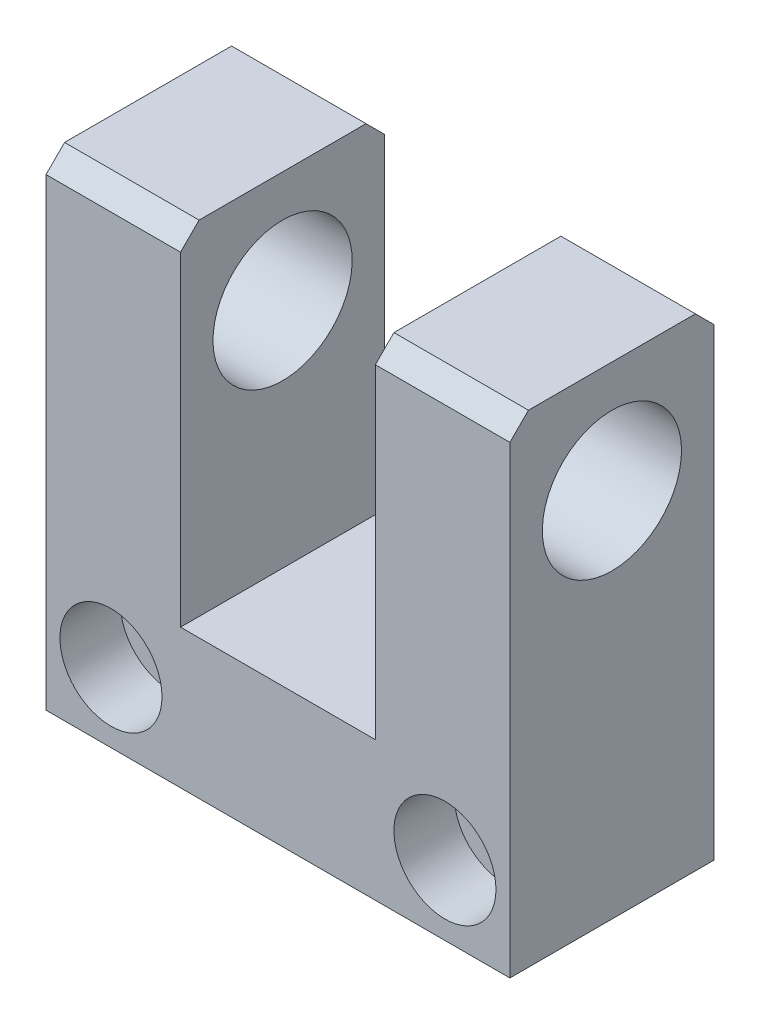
ISO-10303-21;
HEADER;
FILE_DESCRIPTION(('STEP AP214'),'2;1');
FILE_NAME('part.step','',(''),(''),'','','');
FILE_SCHEMA(('AUTOMOTIVE_DESIGN { 1 0 10303 214 1 1 1 1 }'));
ENDSEC;
DATA;
#1=APPLICATION_CONTEXT('core data for automotive mechanical design processes');
#2=APPLICATION_PROTOCOL_DEFINITION('international standard','automotive_design',2000,#1);
#3=PRODUCT_CONTEXT('',#1,'mechanical');
#4=PRODUCT('Part','Part','',(#3));
#5=PRODUCT_RELATED_PRODUCT_CATEGORY('part','',(#4));
#6=PRODUCT_DEFINITION_FORMATION('','',#4);
#7=PRODUCT_DEFINITION_CONTEXT('part definition',#1,'design');
#8=PRODUCT_DEFINITION('design','',#6,#7);
#9=PRODUCT_DEFINITION_SHAPE('','',#8);
#10=(LENGTH_UNIT() NAMED_UNIT(*) SI_UNIT(.MILLI.,.METRE.));
#11=(NAMED_UNIT(*) PLANE_ANGLE_UNIT() SI_UNIT($,.RADIAN.));
#12=(NAMED_UNIT(*) SI_UNIT($,.STERADIAN.) SOLID_ANGLE_UNIT());
#13=UNCERTAINTY_MEASURE_WITH_UNIT(LENGTH_MEASURE(1.E-05),#10,'distance_accuracy_value','');
#14=(GEOMETRIC_REPRESENTATION_CONTEXT(3) GLOBAL_UNCERTAINTY_ASSIGNED_CONTEXT((#13)) GLOBAL_UNIT_ASSIGNED_CONTEXT((#10,
#11,#12)) REPRESENTATION_CONTEXT('',''));
#15=CARTESIAN_POINT('',(0.,0.,0.));
#16=DIRECTION('',(0.,0.,1.));
#17=DIRECTION('',(1.,0.,0.));
#18=AXIS2_PLACEMENT_3D('',#15,#16,#17);
#19=CARTESIAN_POINT('',(25.,50.,11.));
#20=DIRECTION('',(0.,0.,-1.));
#21=DIRECTION('',(-1.,0.,0.));
#22=AXIS2_PLACEMENT_3D('',#19,#20,#21);
#23=PLANE('',#22);
#24=CARTESIAN_POINT('',(18.,7.5,11.));
#25=DIRECTION('',(0.,0.,1.));
#26=DIRECTION('',(1.,0.,0.));
#27=AXIS2_PLACEMENT_3D('',#24,#25,#26);
#28=CIRCLE('',#27,5.5);
#29=CARTESIAN_POINT('',(23.5,7.5,11.));
#30=VERTEX_POINT('',#29);
#31=EDGE_CURVE('E254',#30,#30,#28,.T.);
#32=ORIENTED_EDGE('',*,*,#31,.F.);
#33=EDGE_LOOP('',(#32));
#34=FACE_BOUND('',#33,.T.);
#35=DIRECTION('',(0.,-1.,0.));
#36=VECTOR('',#35,1.);
#37=CARTESIAN_POINT('',(-10.5,50.,11.));
#38=LINE('',#37,#36);
#39=CARTESIAN_POINT('',(-10.5,50.,11.));
#40=VERTEX_POINT('',#39);
#41=CARTESIAN_POINT('',(-10.5,15.,11.));
#42=VERTEX_POINT('',#41);
#43=EDGE_CURVE('E157',#40,#42,#38,.T.);
#44=ORIENTED_EDGE('',*,*,#43,.F.);
#45=DIRECTION('',(-1.,0.,0.));
#46=VECTOR('',#45,1.);
#47=CARTESIAN_POINT('',(25.,50.,11.));
#48=LINE('',#47,#46);
#49=CARTESIAN_POINT('',(-25.,50.,11.));
#50=VERTEX_POINT('',#49);
#51=EDGE_CURVE('E196',#40,#50,#48,.T.);
#52=ORIENTED_EDGE('',*,*,#51,.T.);
#53=DIRECTION('',(0.,-1.,0.));
#54=VECTOR('',#53,1.);
#55=CARTESIAN_POINT('',(-25.,50.,11.));
#56=LINE('',#55,#54);
#57=CARTESIAN_POINT('',(-25.,0.,11.));
#58=VERTEX_POINT('',#57);
#59=EDGE_CURVE('E164',#50,#58,#56,.T.);
#60=ORIENTED_EDGE('',*,*,#59,.T.);
#61=DIRECTION('',(-1.,0.,0.));
#62=VECTOR('',#61,1.);
#63=CARTESIAN_POINT('',(25.,0.,11.));
#64=LINE('',#63,#62);
#65=CARTESIAN_POINT('',(25.,0.,11.));
#66=VERTEX_POINT('',#65);
#67=EDGE_CURVE('E42',#66,#58,#64,.T.);
#68=ORIENTED_EDGE('',*,*,#67,.F.);
#69=DIRECTION('',(0.,-1.,0.));
#70=VECTOR('',#69,1.);
#71=CARTESIAN_POINT('',(25.,50.,11.));
#72=LINE('',#71,#70);
#73=CARTESIAN_POINT('',(25.,50.,11.));
#74=VERTEX_POINT('',#73);
#75=EDGE_CURVE('E185',#74,#66,#72,.T.);
#76=ORIENTED_EDGE('',*,*,#75,.F.);
#77=CARTESIAN_POINT('',(10.5,50.,11.));
#78=VERTEX_POINT('',#77);
#79=EDGE_CURVE('E144',#74,#78,#48,.T.);
#80=ORIENTED_EDGE('',*,*,#79,.T.);
#81=DIRECTION('',(0.,1.,0.));
#82=VECTOR('',#81,1.);
#83=CARTESIAN_POINT('',(10.5,50.,11.));
#84=LINE('',#83,#82);
#85=CARTESIAN_POINT('',(10.5,15.,11.));
#86=VERTEX_POINT('',#85);
#87=EDGE_CURVE('E49',#86,#78,#84,.T.);
#88=ORIENTED_EDGE('',*,*,#87,.F.);
#89=DIRECTION('',(1.,0.,0.));
#90=VECTOR('',#89,1.);
#91=CARTESIAN_POINT('',(25.,15.,11.));
#92=LINE('',#91,#90);
#93=EDGE_CURVE('E125',#42,#86,#92,.T.);
#94=ORIENTED_EDGE('',*,*,#93,.F.);
#95=EDGE_LOOP('',(#44,#52,#60,#68,#76,#80,#88,#94));
#96=FACE_BOUND('',#95,.T.);
#97=CARTESIAN_POINT('',(-18.,7.5,11.));
#98=DIRECTION('',(0.,0.,1.));
#99=DIRECTION('',(1.,0.,0.));
#100=AXIS2_PLACEMENT_3D('',#97,#98,#99);
#101=CIRCLE('',#100,5.5);
#102=CARTESIAN_POINT('',(-12.5,7.5,11.));
#103=VERTEX_POINT('',#102);
#104=EDGE_CURVE('E269',#103,#103,#101,.T.);
#105=ORIENTED_EDGE('',*,*,#104,.F.);
#106=EDGE_LOOP('',(#105));
#107=FACE_BOUND('',#106,.T.);
#108=ADVANCED_FACE('F35',(#34,#96,#107),#23,.F.);
#109=CARTESIAN_POINT('',(25.,0.,-11.));
#110=DIRECTION('',(0.,0.,1.));
#111=DIRECTION('',(1.,0.,0.));
#112=AXIS2_PLACEMENT_3D('',#109,#110,#111);
#113=PLANE('',#112);
#114=CARTESIAN_POINT('',(18.,7.5,-11.));
#115=DIRECTION('',(0.,0.,1.));
#116=DIRECTION('',(1.,0.,0.));
#117=AXIS2_PLACEMENT_3D('',#114,#115,#116);
#118=CIRCLE('',#117,3.25);
#119=CARTESIAN_POINT('',(21.25,7.5,-11.));
#120=VERTEX_POINT('',#119);
#121=EDGE_CURVE('E266',#120,#120,#118,.T.);
#122=ORIENTED_EDGE('',*,*,#121,.T.);
#123=EDGE_LOOP('',(#122));
#124=FACE_BOUND('',#123,.T.);
#125=DIRECTION('',(0.,1.,0.));
#126=VECTOR('',#125,1.);
#127=CARTESIAN_POINT('',(-10.5,0.,-11.));
#128=LINE('',#127,#126);
#129=CARTESIAN_POINT('',(-10.5,15.,-11.));
#130=VERTEX_POINT('',#129);
#131=CARTESIAN_POINT('',(-10.5,50.,-11.));
#132=VERTEX_POINT('',#131);
#133=EDGE_CURVE('E134',#130,#132,#128,.T.);
#134=ORIENTED_EDGE('',*,*,#133,.F.);
#135=DIRECTION('',(-1.,0.,0.));
#136=VECTOR('',#135,1.);
#137=CARTESIAN_POINT('',(25.,15.,-11.));
#138=LINE('',#137,#136);
#139=CARTESIAN_POINT('',(10.5,15.,-11.));
#140=VERTEX_POINT('',#139);
#141=EDGE_CURVE('E11',#140,#130,#138,.T.);
#142=ORIENTED_EDGE('',*,*,#141,.F.);
#143=DIRECTION('',(0.,-1.,0.));
#144=VECTOR('',#143,1.);
#145=CARTESIAN_POINT('',(10.5,0.,-11.));
#146=LINE('',#145,#144);
#147=CARTESIAN_POINT('',(10.5,50.,-11.));
#148=VERTEX_POINT('',#147);
#149=EDGE_CURVE('E138',#148,#140,#146,.T.);
#150=ORIENTED_EDGE('',*,*,#149,.F.);
#151=DIRECTION('',(-1.,0.,0.));
#152=VECTOR('',#151,1.);
#153=CARTESIAN_POINT('',(25.,50.,-11.));
#154=LINE('',#153,#152);
#155=CARTESIAN_POINT('',(25.,50.,-11.));
#156=VERTEX_POINT('',#155);
#157=EDGE_CURVE('E207',#156,#148,#154,.T.);
#158=ORIENTED_EDGE('',*,*,#157,.F.);
#159=DIRECTION('',(0.,1.,0.));
#160=VECTOR('',#159,1.);
#161=CARTESIAN_POINT('',(25.,0.,-11.));
#162=LINE('',#161,#160);
#163=CARTESIAN_POINT('',(25.,0.,-11.));
#164=VERTEX_POINT('',#163);
#165=EDGE_CURVE('E189',#164,#156,#162,.T.);
#166=ORIENTED_EDGE('',*,*,#165,.F.);
#167=DIRECTION('',(-1.,0.,0.));
#168=VECTOR('',#167,1.);
#169=CARTESIAN_POINT('',(25.,0.,-11.));
#170=LINE('',#169,#168);
#171=CARTESIAN_POINT('',(-25.,0.,-11.));
#172=VERTEX_POINT('',#171);
#173=EDGE_CURVE('E210',#164,#172,#170,.T.);
#174=ORIENTED_EDGE('',*,*,#173,.T.);
#175=DIRECTION('',(0.,1.,0.));
#176=VECTOR('',#175,1.);
#177=CARTESIAN_POINT('',(-25.,0.,-11.));
#178=LINE('',#177,#176);
#179=CARTESIAN_POINT('',(-25.,50.,-11.));
#180=VERTEX_POINT('',#179);
#181=EDGE_CURVE('E170',#172,#180,#178,.T.);
#182=ORIENTED_EDGE('',*,*,#181,.T.);
#183=EDGE_CURVE('E206',#132,#180,#154,.T.);
#184=ORIENTED_EDGE('',*,*,#183,.F.);
#185=EDGE_LOOP('',(#134,#142,#150,#158,#166,#174,#182,#184));
#186=FACE_BOUND('',#185,.T.);
#187=CARTESIAN_POINT('',(-18.,7.5,-11.));
#188=DIRECTION('',(0.,0.,1.));
#189=DIRECTION('',(1.,0.,0.));
#190=AXIS2_PLACEMENT_3D('',#187,#188,#189);
#191=CIRCLE('',#190,3.25);
#192=CARTESIAN_POINT('',(-14.75,7.5,-11.));
#193=VERTEX_POINT('',#192);
#194=EDGE_CURVE('E278',#193,#193,#191,.T.);
#195=ORIENTED_EDGE('',*,*,#194,.T.);
#196=EDGE_LOOP('',(#195));
#197=FACE_BOUND('',#196,.T.);
#198=ADVANCED_FACE('F232',(#124,#186,#197),#113,.F.);
#199=CARTESIAN_POINT('',(25.,50.,-11.));
#200=DIRECTION('',(0.,-0.707106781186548,0.707106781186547));
#201=DIRECTION('',(0.,-0.707106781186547,-0.707106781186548));
#202=AXIS2_PLACEMENT_3D('',#199,#200,#201);
#203=PLANE('',#202);
#204=DIRECTION('',(0.,0.707106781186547,0.707106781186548));
#205=VECTOR('',#204,1.);
#206=CARTESIAN_POINT('',(-10.5,50.,-11.));
#207=LINE('',#206,#205);
#208=CARTESIAN_POINT('',(-10.5,52.,-9.));
#209=VERTEX_POINT('',#208);
#210=EDGE_CURVE('E159',#132,#209,#207,.T.);
#211=ORIENTED_EDGE('',*,*,#210,.F.);
#212=ORIENTED_EDGE('',*,*,#183,.T.);
#213=DIRECTION('',(0.,0.707106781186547,0.707106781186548));
#214=VECTOR('',#213,1.);
#215=CARTESIAN_POINT('',(-25.,50.,-11.));
#216=LINE('',#215,#214);
#217=CARTESIAN_POINT('',(-25.,52.,-9.));
#218=VERTEX_POINT('',#217);
#219=EDGE_CURVE('E173',#180,#218,#216,.T.);
#220=ORIENTED_EDGE('',*,*,#219,.T.);
#221=DIRECTION('',(-1.,0.,0.));
#222=VECTOR('',#221,1.);
#223=CARTESIAN_POINT('',(25.,52.,-9.));
#224=LINE('',#223,#222);
#225=EDGE_CURVE('E202',#209,#218,#224,.T.);
#226=ORIENTED_EDGE('',*,*,#225,.F.);
#227=EDGE_LOOP('',(#211,#212,#220,#226));
#228=FACE_BOUND('',#227,.T.);
#229=ADVANCED_FACE('F230',(#228),#203,.F.);
#230=DIRECTION('',(0.,-0.707106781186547,-0.707106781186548));
#231=VECTOR('',#230,1.);
#232=CARTESIAN_POINT('',(10.5,50.,-11.));
#233=LINE('',#232,#231);
#234=CARTESIAN_POINT('',(10.5,52.,-9.));
#235=VERTEX_POINT('',#234);
#236=EDGE_CURVE('E145',#235,#148,#233,.T.);
#237=ORIENTED_EDGE('',*,*,#236,.F.);
#238=CARTESIAN_POINT('',(25.,52.,-9.));
#239=VERTEX_POINT('',#238);
#240=EDGE_CURVE('E203',#239,#235,#224,.T.);
#241=ORIENTED_EDGE('',*,*,#240,.F.);
#242=DIRECTION('',(0.,0.707106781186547,0.707106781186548));
#243=VECTOR('',#242,1.);
#244=CARTESIAN_POINT('',(25.,50.,-11.));
#245=LINE('',#244,#243);
#246=EDGE_CURVE('E191',#156,#239,#245,.T.);
#247=ORIENTED_EDGE('',*,*,#246,.F.);
#248=ORIENTED_EDGE('',*,*,#157,.T.);
#249=EDGE_LOOP('',(#237,#241,#247,#248));
#250=FACE_BOUND('',#249,.T.);
#251=ADVANCED_FACE('F346',(#250),#203,.F.);
#252=CARTESIAN_POINT('',(25.,52.,-9.));
#253=DIRECTION('',(0.,-1.,0.));
#254=DIRECTION('',(0.,0.,-1.));
#255=AXIS2_PLACEMENT_3D('',#252,#253,#254);
#256=PLANE('',#255);
#257=DIRECTION('',(0.,0.,-1.));
#258=VECTOR('',#257,1.);
#259=CARTESIAN_POINT('',(-10.5,52.,12.));
#260=LINE('',#259,#258);
#261=CARTESIAN_POINT('',(-10.5,52.,9.));
#262=VERTEX_POINT('',#261);
#263=EDGE_CURVE('E253',#262,#209,#260,.T.);
#264=ORIENTED_EDGE('',*,*,#263,.T.);
#265=ORIENTED_EDGE('',*,*,#225,.T.);
#266=DIRECTION('',(0.,0.,1.));
#267=VECTOR('',#266,1.);
#268=CARTESIAN_POINT('',(-25.,52.,-9.));
#269=LINE('',#268,#267);
#270=CARTESIAN_POINT('',(-25.,52.,9.));
#271=VERTEX_POINT('',#270);
#272=EDGE_CURVE('E176',#218,#271,#269,.T.);
#273=ORIENTED_EDGE('',*,*,#272,.T.);
#274=DIRECTION('',(-1.,0.,0.));
#275=VECTOR('',#274,1.);
#276=CARTESIAN_POINT('',(25.,52.,9.));
#277=LINE('',#276,#275);
#278=EDGE_CURVE('E198',#262,#271,#277,.T.);
#279=ORIENTED_EDGE('',*,*,#278,.F.);
#280=EDGE_LOOP('',(#264,#265,#273,#279));
#281=FACE_BOUND('',#280,.T.);
#282=ADVANCED_FACE('F252',(#281),#256,.F.);
#283=DIRECTION('',(0.,0.,-1.));
#284=VECTOR('',#283,1.);
#285=CARTESIAN_POINT('',(10.5,52.,12.));
#286=LINE('',#285,#284);
#287=CARTESIAN_POINT('',(10.5,52.,9.));
#288=VERTEX_POINT('',#287);
#289=EDGE_CURVE('E139',#288,#235,#286,.T.);
#290=ORIENTED_EDGE('',*,*,#289,.F.);
#291=CARTESIAN_POINT('',(25.,52.,9.));
#292=VERTEX_POINT('',#291);
#293=EDGE_CURVE('E199',#292,#288,#277,.T.);
#294=ORIENTED_EDGE('',*,*,#293,.F.);
#295=DIRECTION('',(0.,0.,1.));
#296=VECTOR('',#295,1.);
#297=CARTESIAN_POINT('',(25.,52.,-9.));
#298=LINE('',#297,#296);
#299=EDGE_CURVE('E193',#239,#292,#298,.T.);
#300=ORIENTED_EDGE('',*,*,#299,.F.);
#301=ORIENTED_EDGE('',*,*,#240,.T.);
#302=EDGE_LOOP('',(#290,#294,#300,#301));
#303=FACE_BOUND('',#302,.T.);
#304=ADVANCED_FACE('F343',(#303),#256,.F.);
#305=CARTESIAN_POINT('',(25.,52.,9.));
#306=DIRECTION('',(0.,-0.707106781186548,-0.707106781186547));
#307=DIRECTION('',(0.,0.707106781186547,-0.707106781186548));
#308=AXIS2_PLACEMENT_3D('',#305,#306,#307);
#309=PLANE('',#308);
#310=DIRECTION('',(0.,-0.707106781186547,0.707106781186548));
#311=VECTOR('',#310,1.);
#312=CARTESIAN_POINT('',(-10.5,52.,9.));
#313=LINE('',#312,#311);
#314=EDGE_CURVE('E155',#262,#40,#313,.T.);
#315=ORIENTED_EDGE('',*,*,#314,.F.);
#316=ORIENTED_EDGE('',*,*,#278,.T.);
#317=DIRECTION('',(0.,-0.707106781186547,0.707106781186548));
#318=VECTOR('',#317,1.);
#319=CARTESIAN_POINT('',(-25.,52.,9.));
#320=LINE('',#319,#318);
#321=EDGE_CURVE('E179',#271,#50,#320,.T.);
#322=ORIENTED_EDGE('',*,*,#321,.T.);
#323=ORIENTED_EDGE('',*,*,#51,.F.);
#324=EDGE_LOOP('',(#315,#316,#322,#323));
#325=FACE_BOUND('',#324,.T.);
#326=ADVANCED_FACE('F249',(#325),#309,.F.);
#327=DIRECTION('',(0.,0.707106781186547,-0.707106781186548));
#328=VECTOR('',#327,1.);
#329=CARTESIAN_POINT('',(10.5,52.,9.));
#330=LINE('',#329,#328);
#331=EDGE_CURVE('E146',#78,#288,#330,.T.);
#332=ORIENTED_EDGE('',*,*,#331,.F.);
#333=ORIENTED_EDGE('',*,*,#79,.F.);
#334=DIRECTION('',(0.,-0.707106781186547,0.707106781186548));
#335=VECTOR('',#334,1.);
#336=CARTESIAN_POINT('',(25.,52.,9.));
#337=LINE('',#336,#335);
#338=EDGE_CURVE('E57',#292,#74,#337,.T.);
#339=ORIENTED_EDGE('',*,*,#338,.F.);
#340=ORIENTED_EDGE('',*,*,#293,.T.);
#341=EDGE_LOOP('',(#332,#333,#339,#340));
#342=FACE_BOUND('',#341,.T.);
#343=ADVANCED_FACE('F336',(#342),#309,.F.);
#344=CARTESIAN_POINT('',(25.,40.,0.));
#345=DIRECTION('',(-1.,0.,0.));
#346=DIRECTION('',(0.,0.,1.));
#347=AXIS2_PLACEMENT_3D('',#344,#345,#346);
#348=CYLINDRICAL_SURFACE('',#347,7.5);
#349=CARTESIAN_POINT('',(-25.,40.,0.));
#350=DIRECTION('',(1.,0.,0.));
#351=DIRECTION('',(0.,0.,-1.));
#352=AXIS2_PLACEMENT_3D('',#349,#350,#351);
#353=CIRCLE('',#352,7.5);
#354=CARTESIAN_POINT('',(-25.,40.,-7.5));
#355=VERTEX_POINT('',#354);
#356=EDGE_CURVE('E133',#355,#355,#353,.T.);
#357=ORIENTED_EDGE('',*,*,#356,.F.);
#358=EDGE_LOOP('',(#357));
#359=FACE_BOUND('',#358,.T.);
#360=CARTESIAN_POINT('',(-10.5,40.,0.));
#361=DIRECTION('',(1.,0.,0.));
#362=DIRECTION('',(0.,1.,0.));
#363=AXIS2_PLACEMENT_3D('',#360,#361,#362);
#364=CIRCLE('',#363,7.5);
#365=CARTESIAN_POINT('',(-10.5,47.5,0.));
#366=VERTEX_POINT('',#365);
#367=EDGE_CURVE('E154',#366,#366,#364,.T.);
#368=ORIENTED_EDGE('',*,*,#367,.T.);
#369=EDGE_LOOP('',(#368));
#370=FACE_BOUND('',#369,.T.);
#371=ADVANCED_FACE('F217',(#359,#370),#348,.F.);
#372=CARTESIAN_POINT('',(25.,40.,0.));
#373=DIRECTION('',(1.,0.,0.));
#374=DIRECTION('',(0.,0.,-1.));
#375=AXIS2_PLACEMENT_3D('',#372,#373,#374);
#376=CIRCLE('',#375,7.5);
#377=CARTESIAN_POINT('',(25.,40.,-7.5));
#378=VERTEX_POINT('',#377);
#379=EDGE_CURVE('E182',#378,#378,#376,.T.);
#380=ORIENTED_EDGE('',*,*,#379,.T.);
#381=EDGE_LOOP('',(#380));
#382=FACE_BOUND('',#381,.T.);
#383=CARTESIAN_POINT('',(10.5,40.,0.));
#384=DIRECTION('',(-1.,0.,0.));
#385=DIRECTION('',(0.,-1.,0.));
#386=AXIS2_PLACEMENT_3D('',#383,#384,#385);
#387=CIRCLE('',#386,7.5);
#388=CARTESIAN_POINT('',(10.5,32.5,0.));
#389=VERTEX_POINT('',#388);
#390=EDGE_CURVE('E149',#389,#389,#387,.T.);
#391=ORIENTED_EDGE('',*,*,#390,.T.);
#392=EDGE_LOOP('',(#391));
#393=FACE_BOUND('',#392,.T.);
#394=ADVANCED_FACE('F335',(#382,#393),#348,.F.);
#395=CARTESIAN_POINT('',(25.,0.,0.));
#396=DIRECTION('',(1.,0.,0.));
#397=DIRECTION('',(0.,0.,-1.));
#398=AXIS2_PLACEMENT_3D('',#395,#396,#397);
#399=PLANE('',#398);
#400=ORIENTED_EDGE('',*,*,#75,.T.);
#401=DIRECTION('',(0.,0.,-1.));
#402=VECTOR('',#401,1.);
#403=CARTESIAN_POINT('',(25.,0.,11.));
#404=LINE('',#403,#402);
#405=EDGE_CURVE('E187',#66,#164,#404,.T.);
#406=ORIENTED_EDGE('',*,*,#405,.T.);
#407=ORIENTED_EDGE('',*,*,#165,.T.);
#408=ORIENTED_EDGE('',*,*,#246,.T.);
#409=ORIENTED_EDGE('',*,*,#299,.T.);
#410=ORIENTED_EDGE('',*,*,#338,.T.);
#411=EDGE_LOOP('',(#400,#406,#407,#408,#409,#410));
#412=FACE_BOUND('',#411,.T.);
#413=ORIENTED_EDGE('',*,*,#379,.F.);
#414=EDGE_LOOP('',(#413));
#415=FACE_BOUND('',#414,.T.);
#416=ADVANCED_FACE('F338',(#412,#415),#399,.T.);
#417=CARTESIAN_POINT('',(25.,0.,11.));
#418=DIRECTION('',(0.,1.,0.));
#419=DIRECTION('',(0.,0.,1.));
#420=AXIS2_PLACEMENT_3D('',#417,#418,#419);
#421=PLANE('',#420);
#422=ORIENTED_EDGE('',*,*,#67,.T.);
#423=DIRECTION('',(0.,0.,-1.));
#424=VECTOR('',#423,1.);
#425=CARTESIAN_POINT('',(-25.,0.,11.));
#426=LINE('',#425,#424);
#427=EDGE_CURVE('E167',#58,#172,#426,.T.);
#428=ORIENTED_EDGE('',*,*,#427,.T.);
#429=ORIENTED_EDGE('',*,*,#173,.F.);
#430=ORIENTED_EDGE('',*,*,#405,.F.);
#431=EDGE_LOOP('',(#422,#428,#429,#430));
#432=FACE_BOUND('',#431,.T.);
#433=ADVANCED_FACE('F243',(#432),#421,.F.);
#434=CARTESIAN_POINT('',(-25.,0.,0.));
#435=DIRECTION('',(1.,0.,0.));
#436=DIRECTION('',(0.,0.,-1.));
#437=AXIS2_PLACEMENT_3D('',#434,#435,#436);
#438=PLANE('',#437);
#439=ORIENTED_EDGE('',*,*,#356,.T.);
#440=EDGE_LOOP('',(#439));
#441=FACE_BOUND('',#440,.T.);
#442=ORIENTED_EDGE('',*,*,#59,.F.);
#443=ORIENTED_EDGE('',*,*,#321,.F.);
#444=ORIENTED_EDGE('',*,*,#272,.F.);
#445=ORIENTED_EDGE('',*,*,#219,.F.);
#446=ORIENTED_EDGE('',*,*,#181,.F.);
#447=ORIENTED_EDGE('',*,*,#427,.F.);
#448=EDGE_LOOP('',(#442,#443,#444,#445,#446,#447));
#449=FACE_BOUND('',#448,.T.);
#450=ADVANCED_FACE('F240',(#441,#449),#438,.F.);
#451=CARTESIAN_POINT('',(-10.5,15.,12.));
#452=DIRECTION('',(0.,1.,0.));
#453=DIRECTION('',(0.,0.,1.));
#454=AXIS2_PLACEMENT_3D('',#451,#452,#453);
#455=PLANE('',#454);
#456=ORIENTED_EDGE('',*,*,#93,.T.);
#457=DIRECTION('',(0.,0.,-1.));
#458=VECTOR('',#457,1.);
#459=CARTESIAN_POINT('',(10.5,15.,12.));
#460=LINE('',#459,#458);
#461=EDGE_CURVE('E127',#86,#140,#460,.T.);
#462=ORIENTED_EDGE('',*,*,#461,.T.);
#463=ORIENTED_EDGE('',*,*,#141,.T.);
#464=DIRECTION('',(0.,0.,-1.));
#465=VECTOR('',#464,1.);
#466=CARTESIAN_POINT('',(-10.5,15.,12.));
#467=LINE('',#466,#465);
#468=EDGE_CURVE('E130',#42,#130,#467,.T.);
#469=ORIENTED_EDGE('',*,*,#468,.F.);
#470=EDGE_LOOP('',(#456,#462,#463,#469));
#471=FACE_BOUND('',#470,.T.);
#472=ADVANCED_FACE('F126',(#471),#455,.T.);
#473=CARTESIAN_POINT('',(-10.5,52.,12.));
#474=DIRECTION('',(1.,0.,0.));
#475=DIRECTION('',(0.,1.,0.));
#476=AXIS2_PLACEMENT_3D('',#473,#474,#475);
#477=PLANE('',#476);
#478=ORIENTED_EDGE('',*,*,#367,.F.);
#479=EDGE_LOOP('',(#478));
#480=FACE_BOUND('',#479,.T.);
#481=ORIENTED_EDGE('',*,*,#133,.T.);
#482=ORIENTED_EDGE('',*,*,#210,.T.);
#483=ORIENTED_EDGE('',*,*,#263,.F.);
#484=ORIENTED_EDGE('',*,*,#314,.T.);
#485=ORIENTED_EDGE('',*,*,#43,.T.);
#486=ORIENTED_EDGE('',*,*,#468,.T.);
#487=EDGE_LOOP('',(#481,#482,#483,#484,#485,#486));
#488=FACE_BOUND('',#487,.T.);
#489=ADVANCED_FACE('F219',(#480,#488),#477,.T.);
#490=CARTESIAN_POINT('',(10.5,15.,12.));
#491=DIRECTION('',(-1.,0.,0.));
#492=DIRECTION('',(0.,-1.,0.));
#493=AXIS2_PLACEMENT_3D('',#490,#491,#492);
#494=PLANE('',#493);
#495=ORIENTED_EDGE('',*,*,#390,.F.);
#496=EDGE_LOOP('',(#495));
#497=FACE_BOUND('',#496,.T.);
#498=ORIENTED_EDGE('',*,*,#149,.T.);
#499=ORIENTED_EDGE('',*,*,#461,.F.);
#500=ORIENTED_EDGE('',*,*,#87,.T.);
#501=ORIENTED_EDGE('',*,*,#331,.T.);
#502=ORIENTED_EDGE('',*,*,#289,.T.);
#503=ORIENTED_EDGE('',*,*,#236,.T.);
#504=EDGE_LOOP('',(#498,#499,#500,#501,#502,#503));
#505=FACE_BOUND('',#504,.T.);
#506=ADVANCED_FACE('F136',(#497,#505),#494,.T.);
#507=CARTESIAN_POINT('',(18.,7.5,-11.));
#508=DIRECTION('',(0.,0.,1.));
#509=DIRECTION('',(1.,0.,0.));
#510=AXIS2_PLACEMENT_3D('',#507,#508,#509);
#511=CYLINDRICAL_SURFACE('',#510,5.5);
#512=ORIENTED_EDGE('',*,*,#31,.T.);
#513=EDGE_LOOP('',(#512));
#514=FACE_BOUND('',#513,.T.);
#515=CARTESIAN_POINT('',(18.,7.5,4.5));
#516=DIRECTION('',(0.,0.,1.));
#517=DIRECTION('',(1.,0.,0.));
#518=AXIS2_PLACEMENT_3D('',#515,#516,#517);
#519=CIRCLE('',#518,5.5);
#520=CARTESIAN_POINT('',(23.5,7.5,4.5));
#521=VERTEX_POINT('',#520);
#522=EDGE_CURVE('E258',#521,#521,#519,.T.);
#523=ORIENTED_EDGE('',*,*,#522,.F.);
#524=EDGE_LOOP('',(#523));
#525=FACE_BOUND('',#524,.T.);
#526=ADVANCED_FACE('F302',(#514,#525),#511,.F.);
#527=CARTESIAN_POINT('',(18.,13.,4.5));
#528=DIRECTION('',(0.,0.,1.));
#529=DIRECTION('',(1.,0.,0.));
#530=AXIS2_PLACEMENT_3D('',#527,#528,#529);
#531=PLANE('',#530);
#532=ORIENTED_EDGE('',*,*,#522,.T.);
#533=EDGE_LOOP('',(#532));
#534=FACE_BOUND('',#533,.T.);
#535=CARTESIAN_POINT('',(18.,7.5,4.5));
#536=DIRECTION('',(0.,0.,1.));
#537=DIRECTION('',(1.,0.,0.));
#538=AXIS2_PLACEMENT_3D('',#535,#536,#537);
#539=CIRCLE('',#538,3.25);
#540=CARTESIAN_POINT('',(21.25,7.5,4.5));
#541=VERTEX_POINT('',#540);
#542=EDGE_CURVE('E263',#541,#541,#539,.T.);
#543=ORIENTED_EDGE('',*,*,#542,.F.);
#544=EDGE_LOOP('',(#543));
#545=FACE_BOUND('',#544,.T.);
#546=ADVANCED_FACE('F305',(#534,#545),#531,.T.);
#547=CARTESIAN_POINT('',(18.,7.5,-11.));
#548=DIRECTION('',(0.,0.,1.));
#549=DIRECTION('',(1.,0.,0.));
#550=AXIS2_PLACEMENT_3D('',#547,#548,#549);
#551=CYLINDRICAL_SURFACE('',#550,3.25);
#552=ORIENTED_EDGE('',*,*,#542,.T.);
#553=EDGE_LOOP('',(#552));
#554=FACE_BOUND('',#553,.T.);
#555=ORIENTED_EDGE('',*,*,#121,.F.);
#556=EDGE_LOOP('',(#555));
#557=FACE_BOUND('',#556,.T.);
#558=ADVANCED_FACE('F311',(#554,#557),#551,.F.);
#559=CARTESIAN_POINT('',(-18.,7.5,-11.));
#560=DIRECTION('',(0.,0.,1.));
#561=DIRECTION('',(1.,0.,0.));
#562=AXIS2_PLACEMENT_3D('',#559,#560,#561);
#563=CYLINDRICAL_SURFACE('',#562,5.5);
#564=ORIENTED_EDGE('',*,*,#104,.T.);
#565=EDGE_LOOP('',(#564));
#566=FACE_BOUND('',#565,.T.);
#567=CARTESIAN_POINT('',(-18.,7.5,4.5));
#568=DIRECTION('',(0.,0.,1.));
#569=DIRECTION('',(1.,0.,0.));
#570=AXIS2_PLACEMENT_3D('',#567,#568,#569);
#571=CIRCLE('',#570,5.5);
#572=CARTESIAN_POINT('',(-12.5,7.5,4.5));
#573=VERTEX_POINT('',#572);
#574=EDGE_CURVE('E272',#573,#573,#571,.T.);
#575=ORIENTED_EDGE('',*,*,#574,.F.);
#576=EDGE_LOOP('',(#575));
#577=FACE_BOUND('',#576,.T.);
#578=ADVANCED_FACE('F290',(#566,#577),#563,.F.);
#579=CARTESIAN_POINT('',(-18.,13.,4.5));
#580=DIRECTION('',(0.,0.,1.));
#581=DIRECTION('',(1.,0.,0.));
#582=AXIS2_PLACEMENT_3D('',#579,#580,#581);
#583=PLANE('',#582);
#584=ORIENTED_EDGE('',*,*,#574,.T.);
#585=EDGE_LOOP('',(#584));
#586=FACE_BOUND('',#585,.T.);
#587=CARTESIAN_POINT('',(-18.,7.5,4.5));
#588=DIRECTION('',(0.,0.,1.));
#589=DIRECTION('',(1.,0.,0.));
#590=AXIS2_PLACEMENT_3D('',#587,#588,#589);
#591=CIRCLE('',#590,3.25);
#592=CARTESIAN_POINT('',(-14.75,7.5,4.5));
#593=VERTEX_POINT('',#592);
#594=EDGE_CURVE('E275',#593,#593,#591,.T.);
#595=ORIENTED_EDGE('',*,*,#594,.F.);
#596=EDGE_LOOP('',(#595));
#597=FACE_BOUND('',#596,.T.);
#598=ADVANCED_FACE('F284',(#586,#597),#583,.T.);
#599=CARTESIAN_POINT('',(-18.,7.5,-11.));
#600=DIRECTION('',(0.,0.,1.));
#601=DIRECTION('',(1.,0.,0.));
#602=AXIS2_PLACEMENT_3D('',#599,#600,#601);
#603=CYLINDRICAL_SURFACE('',#602,3.25);
#604=ORIENTED_EDGE('',*,*,#594,.T.);
#605=EDGE_LOOP('',(#604));
#606=FACE_BOUND('',#605,.T.);
#607=ORIENTED_EDGE('',*,*,#194,.F.);
#608=EDGE_LOOP('',(#607));
#609=FACE_BOUND('',#608,.T.);
#610=ADVANCED_FACE('F282',(#606,#609),#603,.F.);
#611=CLOSED_SHELL('',(#108,#198,#229,#251,#282,#304,#326,#343,#371,#394,#416,#433,#450,#472,
#489,#506,#526,#546,#558,#578,#598,#610));
#612=MANIFOLD_SOLID_BREP('B2',#611);
#613=ADVANCED_BREP_SHAPE_REPRESENTATION('',(#18,#612),#14);
#614=SHAPE_DEFINITION_REPRESENTATION(#9,#613);
ENDSEC;
END-ISO-10303-21;
